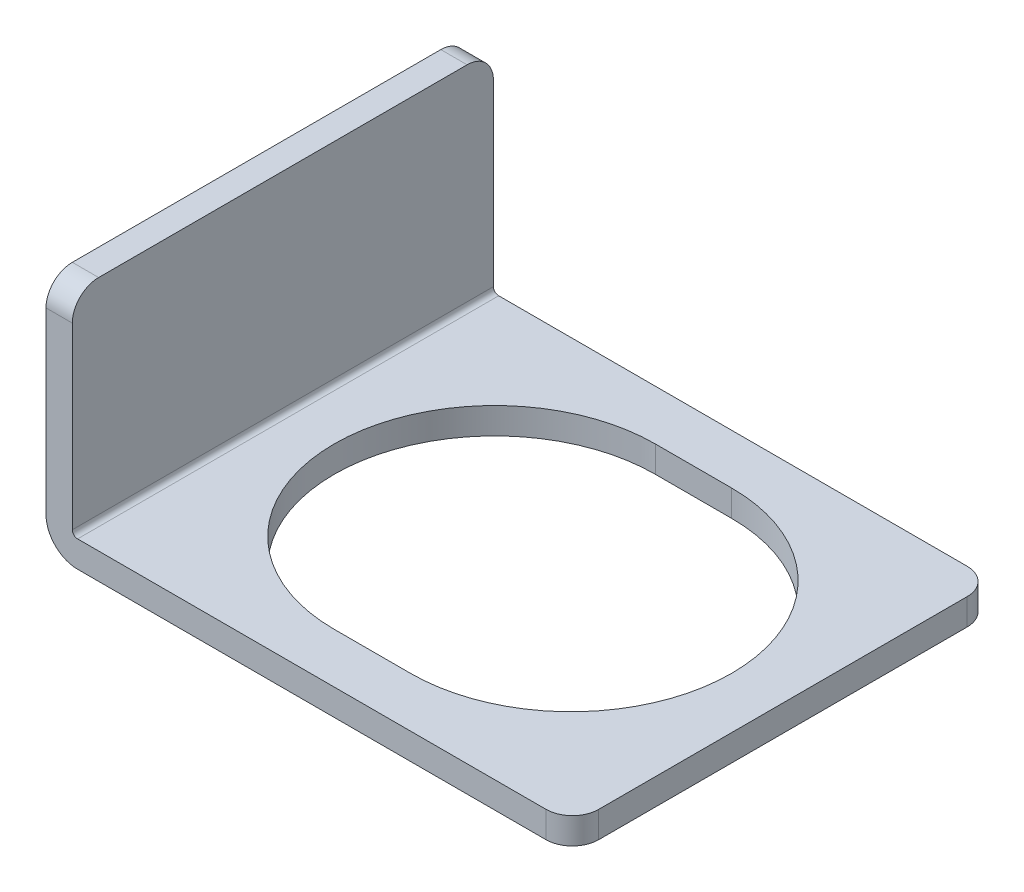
from build123d import *

# Parameters (mm, degrees)
BOSS_EXTRUDE1_DEPTH = 8
CUT_EXTRUDE1_DEPTH  = 23.978250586
FILLET1_R           = 1


with BuildPart() as part:
    # Sketch1 → Boss-Extrude1 (new, symmetric)
    with BuildSketch(Plane.XY):
        with BuildLine():
            Line((0, 1.2), (0, 9))
            Line((0, 9), (1, 9))
            Line((1, 9), (1, 1.2))
            ThreePointArc((1, 1.2), (1.058578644, 1.058578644), (1.2, 1))
            Line((1.2, 1), (20, 1))
            Line((20, 1), (20, 0))
            Line((20, 0), (1.2, 0))
            ThreePointArc((1.2, 0), (0.351471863, 0.351471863), (0, 1.2))
        make_face()
    extrude(amount=BOSS_EXTRUDE1_DEPTH, both=True)

    # Sketch2 → Cut-Extrude1 (cut, through all)
    with BuildSketch(Plane(origin=(0, 1, 0), x_dir=(1, 0, 0), z_dir=(0, 1, 0))):
        with BuildLine():
            Line((9.05, 6.1), (11.95, 6.1))
            ThreePointArc((11.95, 6.1), (18.05, 0), (11.95, -6.1))
            Line((11.95, -6.1), (9.05, -6.1))
            ThreePointArc((9.05, -6.1), (2.95, 0), (9.05, 6.1))
        make_face()
    extrude(amount=-CUT_EXTRUDE1_DEPTH, mode=Mode.SUBTRACT)

    # Fillet1
    fillet1_edges = [part.edges().sort_by_distance(p)[0] for p in [
        (0.5, 9, -8),
        (20, 0.5, 8),
        (0.5, 9, 8),
        (20, 0.5, -8),
    ]]
    fillet(fillet1_edges, radius=FILLET1_R)


solid = part.part
